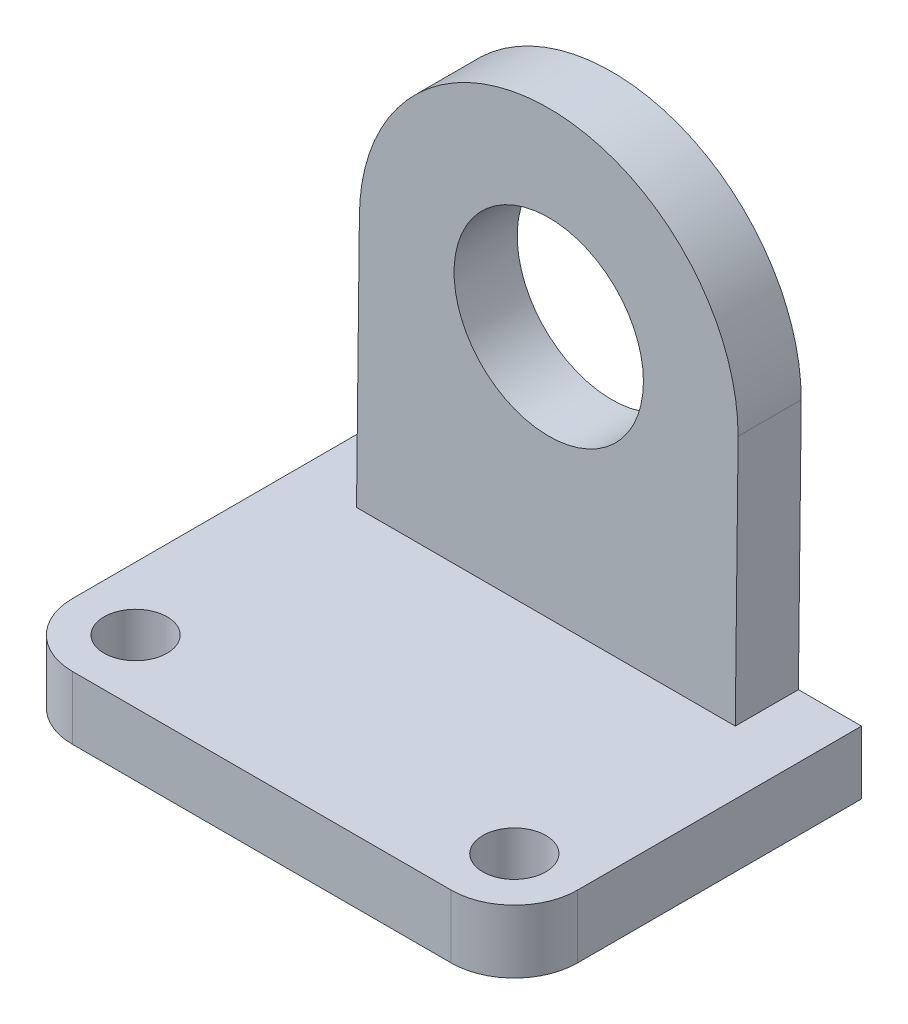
from build123d import *

# Parameters (mm, degrees)
SKETCH_1_R      = 5
EXTRUDE_1_DEPTH = 10
SKETCH_2_R      = 15
EXTRUDE_2_DEPTH = 10


with BuildPart() as part:
    # Sketch 1 → Extrude 1 (new body)
    with BuildSketch(Plane(origin=(0, 0, 0), x_dir=(1, 0, 0), z_dir=(0, 1, 0))):
        with BuildLine():
            Line((40, 0), (-40, 0))
            Line((-40, 0), (-40, -45))
            ThreePointArc((-40, -45), (-37.071067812, -52.071067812), (-30, -55))
            Line((-30, -55), (30, -55))
            ThreePointArc((30, -55), (37.071067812, -52.071067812), (40, -45))
            Line((40, -45), (40, 0))
        make_face()
        with Locations(Location((-30, -45, 0), (0, 0, 270))):
            Circle(SKETCH_1_R, mode=Mode.SUBTRACT)
        with Locations(Location((30, -45, 0), (0, 0, 90))):
            Circle(SKETCH_1_R, mode=Mode.SUBTRACT)
    extrude(amount=EXTRUDE_1_DEPTH)

    # Sketch 2 → Extrude 2 (add)
    with BuildSketch(Plane.XY):
        with BuildLine():
            Line((-29.547588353, 50), (-30, 10))
            Line((-30, 10), (30, 10))
            Line((30, 10), (30.452411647, 50))
            ThreePointArc((30.452411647, 50), (0.452411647, 80), (-29.547588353, 50))
        make_face()
        with Locations((0.452411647, 50)):
            Circle(SKETCH_2_R, mode=Mode.SUBTRACT)
    extrude(amount=EXTRUDE_2_DEPTH)


solid = part.part
